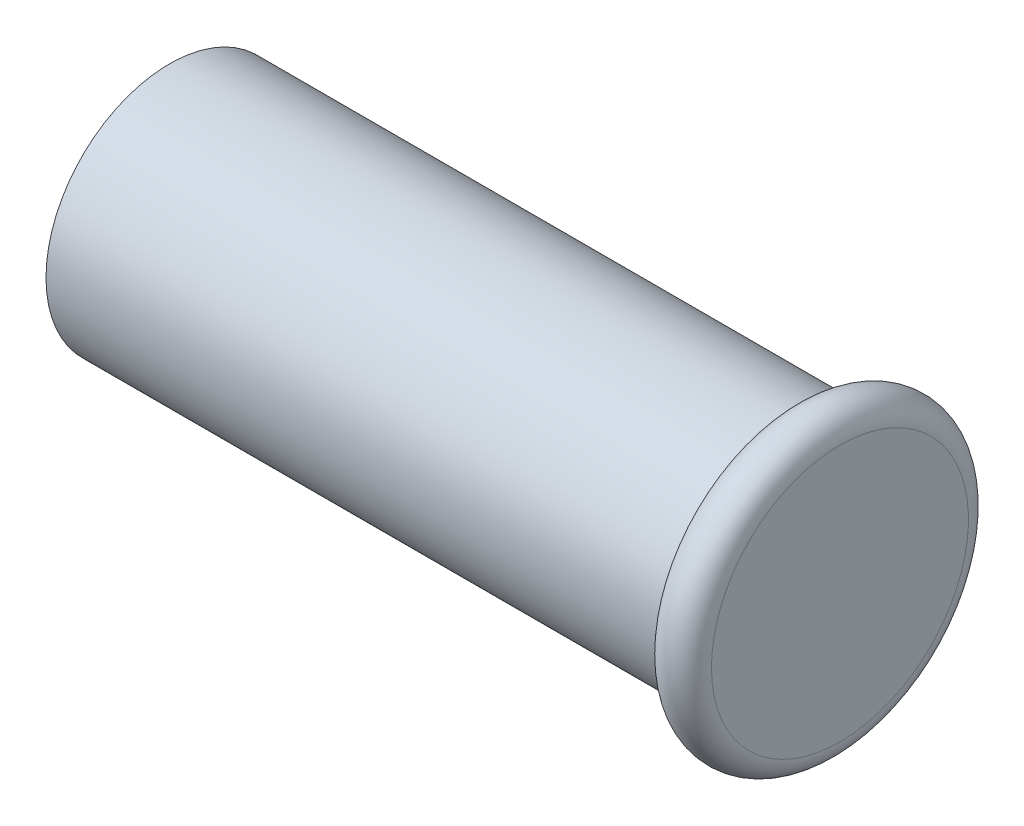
from build123d import *


with BuildPart() as part:
    # Sketch1 → Revolve1 (revolve)
    with BuildSketch(Plane.XY, mode=Mode.PRIVATE) as revolve1_sk:
        with BuildLine():
            Line((0, 0), (0, 2.9845))
            ThreePointArc((0, 2.9845), (-0.5461, 3.5306), (-1.0922, 2.9845))
            Line((-1.0922, 2.9845), (-1.0922, 2.8702))
            Line((-1.0922, 2.8702), (-15.5702, 2.8702))
            Line((-15.5702, 2.8702), (-15.5702, 2.54))
            Line((-15.5702, 2.54), (-1.27, 2.54))
            Line((-1.27, 2.54), (-1.27, 0))
            Line((-1.27, 0), (0, 0))
        make_face()
    revolve(revolve1_sk.sketch.rotate(Axis((-8.937679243, 0, 0), (1, 0, 0)), 90), axis=Axis((-8.937679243, 0, 0), (1, 0, 0)))


solid = part.part
